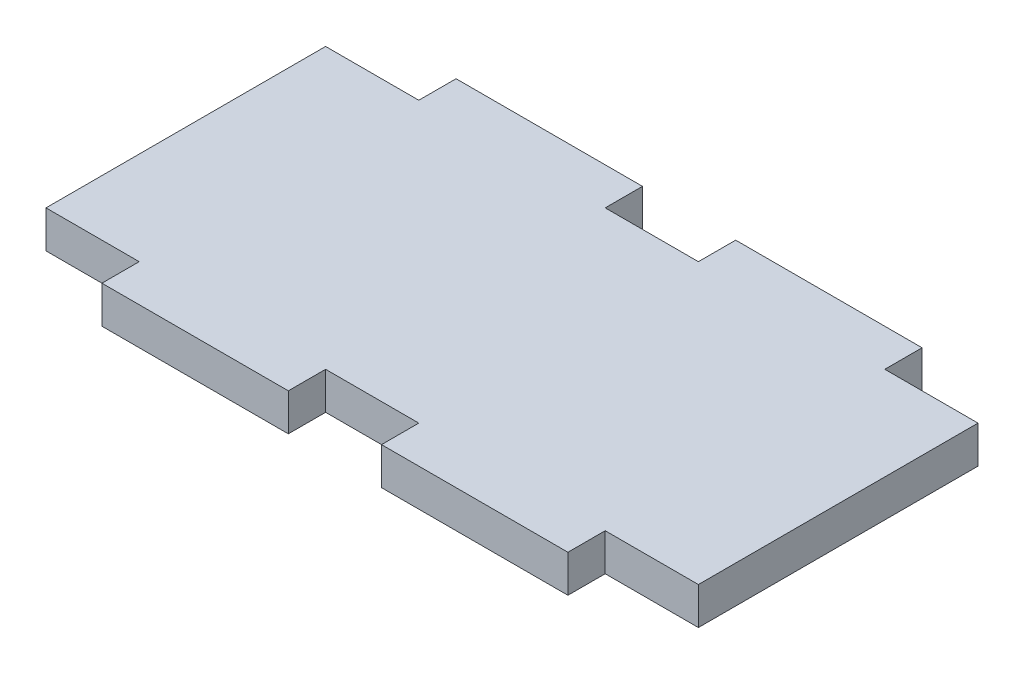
ISO-10303-21;
HEADER;
FILE_DESCRIPTION(('STEP AP214'),'2;1');
FILE_NAME('part.step','',(''),(''),'','','');
FILE_SCHEMA(('AUTOMOTIVE_DESIGN { 1 0 10303 214 1 1 1 1 }'));
ENDSEC;
DATA;
#1=APPLICATION_CONTEXT('core data for automotive mechanical design processes');
#2=APPLICATION_PROTOCOL_DEFINITION('international standard','automotive_design',2000,#1);
#3=PRODUCT_CONTEXT('',#1,'mechanical');
#4=PRODUCT('Part','Part','',(#3));
#5=PRODUCT_RELATED_PRODUCT_CATEGORY('part','',(#4));
#6=PRODUCT_DEFINITION_FORMATION('','',#4);
#7=PRODUCT_DEFINITION_CONTEXT('part definition',#1,'design');
#8=PRODUCT_DEFINITION('design','',#6,#7);
#9=PRODUCT_DEFINITION_SHAPE('','',#8);
#10=(LENGTH_UNIT() NAMED_UNIT(*) SI_UNIT(.MILLI.,.METRE.));
#11=(NAMED_UNIT(*) PLANE_ANGLE_UNIT() SI_UNIT($,.RADIAN.));
#12=(NAMED_UNIT(*) SI_UNIT($,.STERADIAN.) SOLID_ANGLE_UNIT());
#13=UNCERTAINTY_MEASURE_WITH_UNIT(LENGTH_MEASURE(1.E-05),#10,'distance_accuracy_value','');
#14=(GEOMETRIC_REPRESENTATION_CONTEXT(3) GLOBAL_UNCERTAINTY_ASSIGNED_CONTEXT((#13)) GLOBAL_UNIT_ASSIGNED_CONTEXT((#10,
#11,#12)) REPRESENTATION_CONTEXT('',''));
#15=CARTESIAN_POINT('',(0.,0.,0.));
#16=DIRECTION('',(0.,0.,1.));
#17=DIRECTION('',(1.,0.,0.));
#18=AXIS2_PLACEMENT_3D('',#15,#16,#17);
#19=CARTESIAN_POINT('',(0.,2.,-15.));
#20=DIRECTION('',(0.,0.,1.));
#21=DIRECTION('',(1.,0.,0.));
#22=AXIS2_PLACEMENT_3D('',#19,#20,#21);
#23=PLANE('',#22);
#24=DIRECTION('',(0.,-1.,0.));
#25=VECTOR('',#24,1.);
#26=CARTESIAN_POINT('',(15.,0.,-15.));
#27=LINE('',#26,#25);
#28=CARTESIAN_POINT('',(15.,2.,-15.));
#29=VERTEX_POINT('',#28);
#30=CARTESIAN_POINT('',(15.,0.,-15.));
#31=VERTEX_POINT('',#30);
#32=EDGE_CURVE('E56',#29,#31,#27,.T.);
#33=ORIENTED_EDGE('',*,*,#32,.F.);
#34=DIRECTION('',(-1.,0.,0.));
#35=VECTOR('',#34,1.);
#36=CARTESIAN_POINT('',(0.,2.,-15.));
#37=LINE('',#36,#35);
#38=CARTESIAN_POINT('',(20.,2.,-15.));
#39=VERTEX_POINT('',#38);
#40=EDGE_CURVE('E195',#39,#29,#37,.T.);
#41=ORIENTED_EDGE('',*,*,#40,.F.);
#42=DIRECTION('',(0.,1.,0.));
#43=VECTOR('',#42,1.);
#44=CARTESIAN_POINT('',(20.,2.,-15.));
#45=LINE('',#44,#43);
#46=CARTESIAN_POINT('',(20.,0.,-15.));
#47=VERTEX_POINT('',#46);
#48=EDGE_CURVE('E199',#47,#39,#45,.T.);
#49=ORIENTED_EDGE('',*,*,#48,.F.);
#50=DIRECTION('',(-1.,0.,0.));
#51=VECTOR('',#50,1.);
#52=CARTESIAN_POINT('',(0.,0.,-15.));
#53=LINE('',#52,#51);
#54=EDGE_CURVE('E306',#47,#31,#53,.T.);
#55=ORIENTED_EDGE('',*,*,#54,.T.);
#56=EDGE_LOOP('',(#33,#41,#49,#55));
#57=FACE_BOUND('',#56,.T.);
#58=ADVANCED_FACE('F33',(#57),#23,.F.);
#59=DIRECTION('',(0.,1.,0.));
#60=VECTOR('',#59,1.);
#61=CARTESIAN_POINT('',(5.,2.,-15.));
#62=LINE('',#61,#60);
#63=CARTESIAN_POINT('',(5.,0.,-15.));
#64=VERTEX_POINT('',#63);
#65=CARTESIAN_POINT('',(5.,2.,-15.));
#66=VERTEX_POINT('',#65);
#67=EDGE_CURVE('E190',#64,#66,#62,.T.);
#68=ORIENTED_EDGE('',*,*,#67,.F.);
#69=CARTESIAN_POINT('',(0.,0.,-15.));
#70=VERTEX_POINT('',#69);
#71=EDGE_CURVE('E304',#64,#70,#53,.T.);
#72=ORIENTED_EDGE('',*,*,#71,.T.);
#73=DIRECTION('',(0.,-1.,0.));
#74=VECTOR('',#73,1.);
#75=CARTESIAN_POINT('',(0.,2.,-15.));
#76=LINE('',#75,#74);
#77=CARTESIAN_POINT('',(0.,2.,-15.));
#78=VERTEX_POINT('',#77);
#79=EDGE_CURVE('E295',#78,#70,#76,.T.);
#80=ORIENTED_EDGE('',*,*,#79,.F.);
#81=EDGE_CURVE('E48',#66,#78,#37,.T.);
#82=ORIENTED_EDGE('',*,*,#81,.F.);
#83=EDGE_LOOP('',(#68,#72,#80,#82));
#84=FACE_BOUND('',#83,.T.);
#85=ADVANCED_FACE('F371',(#84),#23,.F.);
#86=DIRECTION('',(0.,-1.,0.));
#87=VECTOR('',#86,1.);
#88=CARTESIAN_POINT('',(30.,0.,-15.));
#89=LINE('',#88,#87);
#90=CARTESIAN_POINT('',(30.,2.,-15.));
#91=VERTEX_POINT('',#90);
#92=CARTESIAN_POINT('',(30.,0.,-15.));
#93=VERTEX_POINT('',#92);
#94=EDGE_CURVE('E196',#91,#93,#89,.T.);
#95=ORIENTED_EDGE('',*,*,#94,.F.);
#96=CARTESIAN_POINT('',(35.,2.,-15.));
#97=VERTEX_POINT('',#96);
#98=EDGE_CURVE('E292',#97,#91,#37,.T.);
#99=ORIENTED_EDGE('',*,*,#98,.F.);
#100=DIRECTION('',(0.,-1.,0.));
#101=VECTOR('',#100,1.);
#102=CARTESIAN_POINT('',(35.,2.,-15.));
#103=LINE('',#102,#101);
#104=CARTESIAN_POINT('',(35.,0.,-15.));
#105=VERTEX_POINT('',#104);
#106=EDGE_CURVE('E309',#97,#105,#103,.T.);
#107=ORIENTED_EDGE('',*,*,#106,.T.);
#108=EDGE_CURVE('E285',#105,#93,#53,.T.);
#109=ORIENTED_EDGE('',*,*,#108,.T.);
#110=EDGE_LOOP('',(#95,#99,#107,#109));
#111=FACE_BOUND('',#110,.T.);
#112=ADVANCED_FACE('F328',(#111),#23,.F.);
#113=CARTESIAN_POINT('',(0.,2.,0.));
#114=DIRECTION('',(0.,0.,-1.));
#115=DIRECTION('',(-1.,0.,0.));
#116=AXIS2_PLACEMENT_3D('',#113,#114,#115);
#117=PLANE('',#116);
#118=DIRECTION('',(0.,-1.,0.));
#119=VECTOR('',#118,1.);
#120=CARTESIAN_POINT('',(20.,2.,0.));
#121=LINE('',#120,#119);
#122=CARTESIAN_POINT('',(20.,2.,0.));
#123=VERTEX_POINT('',#122);
#124=CARTESIAN_POINT('',(20.,0.,0.));
#125=VERTEX_POINT('',#124);
#126=EDGE_CURVE('E227',#123,#125,#121,.T.);
#127=ORIENTED_EDGE('',*,*,#126,.F.);
#128=DIRECTION('',(1.,0.,0.));
#129=VECTOR('',#128,1.);
#130=CARTESIAN_POINT('',(0.,2.,0.));
#131=LINE('',#130,#129);
#132=CARTESIAN_POINT('',(15.,2.,0.));
#133=VERTEX_POINT('',#132);
#134=EDGE_CURVE('E290',#133,#123,#131,.T.);
#135=ORIENTED_EDGE('',*,*,#134,.F.);
#136=DIRECTION('',(0.,1.,0.));
#137=VECTOR('',#136,1.);
#138=CARTESIAN_POINT('',(15.,2.,0.));
#139=LINE('',#138,#137);
#140=CARTESIAN_POINT('',(15.,0.,0.));
#141=VERTEX_POINT('',#140);
#142=EDGE_CURVE('E259',#141,#133,#139,.T.);
#143=ORIENTED_EDGE('',*,*,#142,.F.);
#144=DIRECTION('',(1.,0.,0.));
#145=VECTOR('',#144,1.);
#146=CARTESIAN_POINT('',(0.,0.,0.));
#147=LINE('',#146,#145);
#148=EDGE_CURVE('E302',#141,#125,#147,.T.);
#149=ORIENTED_EDGE('',*,*,#148,.T.);
#150=EDGE_LOOP('',(#127,#135,#143,#149));
#151=FACE_BOUND('',#150,.T.);
#152=ADVANCED_FACE('F352',(#151),#117,.F.);
#153=DIRECTION('',(0.,1.,0.));
#154=VECTOR('',#153,1.);
#155=CARTESIAN_POINT('',(30.,2.,0.));
#156=LINE('',#155,#154);
#157=CARTESIAN_POINT('',(30.,0.,0.));
#158=VERTEX_POINT('',#157);
#159=CARTESIAN_POINT('',(30.,2.,0.));
#160=VERTEX_POINT('',#159);
#161=EDGE_CURVE('E232',#158,#160,#156,.T.);
#162=ORIENTED_EDGE('',*,*,#161,.F.);
#163=CARTESIAN_POINT('',(35.,0.,0.));
#164=VERTEX_POINT('',#163);
#165=EDGE_CURVE('E298',#158,#164,#147,.T.);
#166=ORIENTED_EDGE('',*,*,#165,.T.);
#167=DIRECTION('',(0.,-1.,0.));
#168=VECTOR('',#167,1.);
#169=CARTESIAN_POINT('',(35.,2.,0.));
#170=LINE('',#169,#168);
#171=CARTESIAN_POINT('',(35.,2.,0.));
#172=VERTEX_POINT('',#171);
#173=EDGE_CURVE('E41',#172,#164,#170,.T.);
#174=ORIENTED_EDGE('',*,*,#173,.F.);
#175=EDGE_CURVE('E284',#160,#172,#131,.T.);
#176=ORIENTED_EDGE('',*,*,#175,.F.);
#177=EDGE_LOOP('',(#162,#166,#174,#176));
#178=FACE_BOUND('',#177,.T.);
#179=ADVANCED_FACE('F350',(#178),#117,.F.);
#180=DIRECTION('',(0.,-1.,0.));
#181=VECTOR('',#180,1.);
#182=CARTESIAN_POINT('',(5.,2.,0.));
#183=LINE('',#182,#181);
#184=CARTESIAN_POINT('',(5.,2.,0.));
#185=VERTEX_POINT('',#184);
#186=CARTESIAN_POINT('',(5.,0.,0.));
#187=VERTEX_POINT('',#186);
#188=EDGE_CURVE('E254',#185,#187,#183,.T.);
#189=ORIENTED_EDGE('',*,*,#188,.F.);
#190=CARTESIAN_POINT('',(0.,2.,0.));
#191=VERTEX_POINT('',#190);
#192=EDGE_CURVE('E286',#191,#185,#131,.T.);
#193=ORIENTED_EDGE('',*,*,#192,.F.);
#194=DIRECTION('',(0.,-1.,0.));
#195=VECTOR('',#194,1.);
#196=CARTESIAN_POINT('',(0.,2.,0.));
#197=LINE('',#196,#195);
#198=CARTESIAN_POINT('',(0.,0.,0.));
#199=VERTEX_POINT('',#198);
#200=EDGE_CURVE('E11',#191,#199,#197,.T.);
#201=ORIENTED_EDGE('',*,*,#200,.T.);
#202=EDGE_CURVE('E299',#199,#187,#147,.T.);
#203=ORIENTED_EDGE('',*,*,#202,.T.);
#204=EDGE_LOOP('',(#189,#193,#201,#203));
#205=FACE_BOUND('',#204,.T.);
#206=ADVANCED_FACE('F365',(#205),#117,.F.);
#207=CARTESIAN_POINT('',(0.,2.,0.));
#208=DIRECTION('',(1.,0.,0.));
#209=DIRECTION('',(0.,0.,-1.));
#210=AXIS2_PLACEMENT_3D('',#207,#208,#209);
#211=PLANE('',#210);
#212=DIRECTION('',(0.,0.,1.));
#213=VECTOR('',#212,1.);
#214=CARTESIAN_POINT('',(0.,0.,0.));
#215=LINE('',#214,#213);
#216=EDGE_CURVE('E281',#70,#199,#215,.T.);
#217=ORIENTED_EDGE('',*,*,#216,.T.);
#218=ORIENTED_EDGE('',*,*,#200,.F.);
#219=DIRECTION('',(0.,0.,1.));
#220=VECTOR('',#219,1.);
#221=CARTESIAN_POINT('',(0.,2.,0.));
#222=LINE('',#221,#220);
#223=EDGE_CURVE('E282',#78,#191,#222,.T.);
#224=ORIENTED_EDGE('',*,*,#223,.F.);
#225=ORIENTED_EDGE('',*,*,#79,.T.);
#226=EDGE_LOOP('',(#217,#218,#224,#225));
#227=FACE_BOUND('',#226,.T.);
#228=ADVANCED_FACE('F35',(#227),#211,.F.);
#229=CARTESIAN_POINT('',(35.,2.,0.));
#230=DIRECTION('',(-1.,0.,0.));
#231=DIRECTION('',(0.,0.,1.));
#232=AXIS2_PLACEMENT_3D('',#229,#230,#231);
#233=PLANE('',#232);
#234=DIRECTION('',(0.,0.,-1.));
#235=VECTOR('',#234,1.);
#236=CARTESIAN_POINT('',(35.,0.,0.));
#237=LINE('',#236,#235);
#238=EDGE_CURVE('E301',#164,#105,#237,.T.);
#239=ORIENTED_EDGE('',*,*,#238,.T.);
#240=ORIENTED_EDGE('',*,*,#106,.F.);
#241=DIRECTION('',(0.,0.,-1.));
#242=VECTOR('',#241,1.);
#243=CARTESIAN_POINT('',(35.,2.,0.));
#244=LINE('',#243,#242);
#245=EDGE_CURVE('E289',#172,#97,#244,.T.);
#246=ORIENTED_EDGE('',*,*,#245,.F.);
#247=ORIENTED_EDGE('',*,*,#173,.T.);
#248=EDGE_LOOP('',(#239,#240,#246,#247));
#249=FACE_BOUND('',#248,.T.);
#250=ADVANCED_FACE('F316',(#249),#233,.F.);
#251=CARTESIAN_POINT('',(0.,2.,0.));
#252=DIRECTION('',(0.,-1.,0.));
#253=DIRECTION('',(0.,0.,-1.));
#254=AXIS2_PLACEMENT_3D('',#251,#252,#253);
#255=PLANE('',#254);
#256=ORIENTED_EDGE('',*,*,#223,.T.);
#257=ORIENTED_EDGE('',*,*,#192,.T.);
#258=DIRECTION('',(0.,0.,-1.));
#259=VECTOR('',#258,1.);
#260=CARTESIAN_POINT('',(5.,2.,2.));
#261=LINE('',#260,#259);
#262=CARTESIAN_POINT('',(5.,2.,2.));
#263=VERTEX_POINT('',#262);
#264=EDGE_CURVE('E265',#263,#185,#261,.T.);
#265=ORIENTED_EDGE('',*,*,#264,.F.);
#266=DIRECTION('',(-1.,0.,0.));
#267=VECTOR('',#266,1.);
#268=CARTESIAN_POINT('',(5.,2.,2.));
#269=LINE('',#268,#267);
#270=CARTESIAN_POINT('',(15.,2.,2.));
#271=VERTEX_POINT('',#270);
#272=EDGE_CURVE('E263',#271,#263,#269,.T.);
#273=ORIENTED_EDGE('',*,*,#272,.F.);
#274=DIRECTION('',(0.,0.,-1.));
#275=VECTOR('',#274,1.);
#276=CARTESIAN_POINT('',(15.,2.,2.));
#277=LINE('',#276,#275);
#278=EDGE_CURVE('E272',#271,#133,#277,.T.);
#279=ORIENTED_EDGE('',*,*,#278,.T.);
#280=ORIENTED_EDGE('',*,*,#134,.T.);
#281=DIRECTION('',(0.,0.,-1.));
#282=VECTOR('',#281,1.);
#283=CARTESIAN_POINT('',(20.,2.,2.));
#284=LINE('',#283,#282);
#285=CARTESIAN_POINT('',(20.,2.,2.));
#286=VERTEX_POINT('',#285);
#287=EDGE_CURVE('E238',#286,#123,#284,.T.);
#288=ORIENTED_EDGE('',*,*,#287,.F.);
#289=DIRECTION('',(-1.,0.,0.));
#290=VECTOR('',#289,1.);
#291=CARTESIAN_POINT('',(20.,2.,2.));
#292=LINE('',#291,#290);
#293=CARTESIAN_POINT('',(30.,2.,2.));
#294=VERTEX_POINT('',#293);
#295=EDGE_CURVE('E236',#294,#286,#292,.T.);
#296=ORIENTED_EDGE('',*,*,#295,.F.);
#297=DIRECTION('',(0.,0.,-1.));
#298=VECTOR('',#297,1.);
#299=CARTESIAN_POINT('',(30.,2.,2.));
#300=LINE('',#299,#298);
#301=EDGE_CURVE('E245',#294,#160,#300,.T.);
#302=ORIENTED_EDGE('',*,*,#301,.T.);
#303=ORIENTED_EDGE('',*,*,#175,.T.);
#304=ORIENTED_EDGE('',*,*,#245,.T.);
#305=ORIENTED_EDGE('',*,*,#98,.T.);
#306=DIRECTION('',(0.,0.,1.));
#307=VECTOR('',#306,1.);
#308=CARTESIAN_POINT('',(30.,2.,-17.));
#309=LINE('',#308,#307);
#310=CARTESIAN_POINT('',(30.,2.,-17.));
#311=VERTEX_POINT('',#310);
#312=EDGE_CURVE('E224',#311,#91,#309,.T.);
#313=ORIENTED_EDGE('',*,*,#312,.F.);
#314=DIRECTION('',(1.,0.,0.));
#315=VECTOR('',#314,1.);
#316=CARTESIAN_POINT('',(30.,2.,-17.));
#317=LINE('',#316,#315);
#318=CARTESIAN_POINT('',(20.,2.,-17.));
#319=VERTEX_POINT('',#318);
#320=EDGE_CURVE('E205',#319,#311,#317,.T.);
#321=ORIENTED_EDGE('',*,*,#320,.F.);
#322=DIRECTION('',(0.,0.,1.));
#323=VECTOR('',#322,1.);
#324=CARTESIAN_POINT('',(20.,2.,-17.));
#325=LINE('',#324,#323);
#326=EDGE_CURVE('E213',#319,#39,#325,.T.);
#327=ORIENTED_EDGE('',*,*,#326,.T.);
#328=ORIENTED_EDGE('',*,*,#40,.T.);
#329=DIRECTION('',(0.,0.,1.));
#330=VECTOR('',#329,1.);
#331=CARTESIAN_POINT('',(15.,2.,-17.));
#332=LINE('',#331,#330);
#333=CARTESIAN_POINT('',(15.,2.,-17.));
#334=VERTEX_POINT('',#333);
#335=EDGE_CURVE('E175',#334,#29,#332,.T.);
#336=ORIENTED_EDGE('',*,*,#335,.F.);
#337=DIRECTION('',(1.,0.,0.));
#338=VECTOR('',#337,1.);
#339=CARTESIAN_POINT('',(15.,2.,-17.));
#340=LINE('',#339,#338);
#341=CARTESIAN_POINT('',(5.,2.,-17.));
#342=VERTEX_POINT('',#341);
#343=EDGE_CURVE('E181',#342,#334,#340,.T.);
#344=ORIENTED_EDGE('',*,*,#343,.F.);
#345=DIRECTION('',(0.,0.,1.));
#346=VECTOR('',#345,1.);
#347=CARTESIAN_POINT('',(5.,2.,-17.));
#348=LINE('',#347,#346);
#349=EDGE_CURVE('E375',#342,#66,#348,.T.);
#350=ORIENTED_EDGE('',*,*,#349,.T.);
#351=ORIENTED_EDGE('',*,*,#81,.T.);
#352=EDGE_LOOP('',(#256,#257,#265,#273,#279,#280,#288,#296,#302,#303,#304,#305,#313,#321,#327,
#328,#336,#344,#350,#351));
#353=FACE_BOUND('',#352,.T.);
#354=ADVANCED_FACE('F193',(#353),#255,.F.);
#355=CARTESIAN_POINT('',(0.,0.,0.));
#356=DIRECTION('',(0.,-1.,0.));
#357=DIRECTION('',(0.,0.,-1.));
#358=AXIS2_PLACEMENT_3D('',#355,#356,#357);
#359=PLANE('',#358);
#360=ORIENTED_EDGE('',*,*,#216,.F.);
#361=ORIENTED_EDGE('',*,*,#71,.F.);
#362=DIRECTION('',(0.,0.,1.));
#363=VECTOR('',#362,1.);
#364=CARTESIAN_POINT('',(5.,0.,-17.));
#365=LINE('',#364,#363);
#366=CARTESIAN_POINT('',(5.,0.,-17.));
#367=VERTEX_POINT('',#366);
#368=EDGE_CURVE('E201',#367,#64,#365,.T.);
#369=ORIENTED_EDGE('',*,*,#368,.F.);
#370=DIRECTION('',(-1.,0.,0.));
#371=VECTOR('',#370,1.);
#372=CARTESIAN_POINT('',(5.,0.,-17.));
#373=LINE('',#372,#371);
#374=CARTESIAN_POINT('',(15.,0.,-17.));
#375=VERTEX_POINT('',#374);
#376=EDGE_CURVE('E180',#375,#367,#373,.T.);
#377=ORIENTED_EDGE('',*,*,#376,.F.);
#378=DIRECTION('',(0.,0.,1.));
#379=VECTOR('',#378,1.);
#380=CARTESIAN_POINT('',(15.,0.,-17.));
#381=LINE('',#380,#379);
#382=EDGE_CURVE('E177',#375,#31,#381,.T.);
#383=ORIENTED_EDGE('',*,*,#382,.T.);
#384=ORIENTED_EDGE('',*,*,#54,.F.);
#385=DIRECTION('',(0.,0.,1.));
#386=VECTOR('',#385,1.);
#387=CARTESIAN_POINT('',(20.,0.,-17.));
#388=LINE('',#387,#386);
#389=CARTESIAN_POINT('',(20.,0.,-17.));
#390=VERTEX_POINT('',#389);
#391=EDGE_CURVE('E218',#390,#47,#388,.T.);
#392=ORIENTED_EDGE('',*,*,#391,.F.);
#393=DIRECTION('',(-1.,0.,0.));
#394=VECTOR('',#393,1.);
#395=CARTESIAN_POINT('',(20.,0.,-17.));
#396=LINE('',#395,#394);
#397=CARTESIAN_POINT('',(30.,0.,-17.));
#398=VERTEX_POINT('',#397);
#399=EDGE_CURVE('E210',#398,#390,#396,.T.);
#400=ORIENTED_EDGE('',*,*,#399,.F.);
#401=DIRECTION('',(0.,0.,1.));
#402=VECTOR('',#401,1.);
#403=CARTESIAN_POINT('',(30.,0.,-17.));
#404=LINE('',#403,#402);
#405=EDGE_CURVE('E221',#398,#93,#404,.T.);
#406=ORIENTED_EDGE('',*,*,#405,.T.);
#407=ORIENTED_EDGE('',*,*,#108,.F.);
#408=ORIENTED_EDGE('',*,*,#238,.F.);
#409=ORIENTED_EDGE('',*,*,#165,.F.);
#410=DIRECTION('',(0.,0.,-1.));
#411=VECTOR('',#410,1.);
#412=CARTESIAN_POINT('',(30.,0.,2.));
#413=LINE('',#412,#411);
#414=CARTESIAN_POINT('',(30.,0.,2.));
#415=VERTEX_POINT('',#414);
#416=EDGE_CURVE('E248',#415,#158,#413,.T.);
#417=ORIENTED_EDGE('',*,*,#416,.F.);
#418=DIRECTION('',(1.,0.,0.));
#419=VECTOR('',#418,1.);
#420=CARTESIAN_POINT('',(20.,0.,2.));
#421=LINE('',#420,#419);
#422=CARTESIAN_POINT('',(20.,0.,2.));
#423=VERTEX_POINT('',#422);
#424=EDGE_CURVE('E231',#423,#415,#421,.T.);
#425=ORIENTED_EDGE('',*,*,#424,.F.);
#426=DIRECTION('',(0.,0.,-1.));
#427=VECTOR('',#426,1.);
#428=CARTESIAN_POINT('',(20.,0.,2.));
#429=LINE('',#428,#427);
#430=EDGE_CURVE('E251',#423,#125,#429,.T.);
#431=ORIENTED_EDGE('',*,*,#430,.T.);
#432=ORIENTED_EDGE('',*,*,#148,.F.);
#433=DIRECTION('',(0.,0.,-1.));
#434=VECTOR('',#433,1.);
#435=CARTESIAN_POINT('',(15.,0.,2.));
#436=LINE('',#435,#434);
#437=CARTESIAN_POINT('',(15.,0.,2.));
#438=VERTEX_POINT('',#437);
#439=EDGE_CURVE('E275',#438,#141,#436,.T.);
#440=ORIENTED_EDGE('',*,*,#439,.F.);
#441=DIRECTION('',(1.,0.,0.));
#442=VECTOR('',#441,1.);
#443=CARTESIAN_POINT('',(5.,0.,2.));
#444=LINE('',#443,#442);
#445=CARTESIAN_POINT('',(5.,0.,2.));
#446=VERTEX_POINT('',#445);
#447=EDGE_CURVE('E258',#446,#438,#444,.T.);
#448=ORIENTED_EDGE('',*,*,#447,.F.);
#449=DIRECTION('',(0.,0.,-1.));
#450=VECTOR('',#449,1.);
#451=CARTESIAN_POINT('',(5.,0.,2.));
#452=LINE('',#451,#450);
#453=EDGE_CURVE('E278',#446,#187,#452,.T.);
#454=ORIENTED_EDGE('',*,*,#453,.T.);
#455=ORIENTED_EDGE('',*,*,#202,.F.);
#456=EDGE_LOOP('',(#360,#361,#369,#377,#383,#384,#392,#400,#406,#407,#408,#409,#417,#425,#431,
#432,#440,#448,#454,#455));
#457=FACE_BOUND('',#456,.T.);
#458=ADVANCED_FACE('F322',(#457),#359,.T.);
#459=CARTESIAN_POINT('',(5.,2.,2.));
#460=DIRECTION('',(1.,0.,0.));
#461=DIRECTION('',(0.,0.,-1.));
#462=AXIS2_PLACEMENT_3D('',#459,#460,#461);
#463=PLANE('',#462);
#464=ORIENTED_EDGE('',*,*,#188,.T.);
#465=ORIENTED_EDGE('',*,*,#453,.F.);
#466=DIRECTION('',(0.,-1.,0.));
#467=VECTOR('',#466,1.);
#468=CARTESIAN_POINT('',(5.,2.,2.));
#469=LINE('',#468,#467);
#470=EDGE_CURVE('E255',#263,#446,#469,.T.);
#471=ORIENTED_EDGE('',*,*,#470,.F.);
#472=ORIENTED_EDGE('',*,*,#264,.T.);
#473=EDGE_LOOP('',(#464,#465,#471,#472));
#474=FACE_BOUND('',#473,.T.);
#475=ADVANCED_FACE('F363',(#474),#463,.F.);
#476=CARTESIAN_POINT('',(15.,2.,2.));
#477=DIRECTION('',(-1.,0.,0.));
#478=DIRECTION('',(0.,0.,1.));
#479=AXIS2_PLACEMENT_3D('',#476,#477,#478);
#480=PLANE('',#479);
#481=ORIENTED_EDGE('',*,*,#142,.T.);
#482=ORIENTED_EDGE('',*,*,#278,.F.);
#483=DIRECTION('',(0.,1.,0.));
#484=VECTOR('',#483,1.);
#485=CARTESIAN_POINT('',(15.,2.,2.));
#486=LINE('',#485,#484);
#487=EDGE_CURVE('E261',#438,#271,#486,.T.);
#488=ORIENTED_EDGE('',*,*,#487,.F.);
#489=ORIENTED_EDGE('',*,*,#439,.T.);
#490=EDGE_LOOP('',(#481,#482,#488,#489));
#491=FACE_BOUND('',#490,.T.);
#492=ADVANCED_FACE('F356',(#491),#480,.F.);
#493=CARTESIAN_POINT('',(0.,0.,2.));
#494=DIRECTION('',(0.,0.,1.));
#495=DIRECTION('',(1.,0.,0.));
#496=AXIS2_PLACEMENT_3D('',#493,#494,#495);
#497=PLANE('',#496);
#498=ORIENTED_EDGE('',*,*,#470,.T.);
#499=ORIENTED_EDGE('',*,*,#447,.T.);
#500=ORIENTED_EDGE('',*,*,#487,.T.);
#501=ORIENTED_EDGE('',*,*,#272,.T.);
#502=EDGE_LOOP('',(#498,#499,#500,#501));
#503=FACE_BOUND('',#502,.T.);
#504=ADVANCED_FACE('F358',(#503),#497,.T.);
#505=CARTESIAN_POINT('',(20.,2.,2.));
#506=DIRECTION('',(1.,0.,0.));
#507=DIRECTION('',(0.,0.,-1.));
#508=AXIS2_PLACEMENT_3D('',#505,#506,#507);
#509=PLANE('',#508);
#510=ORIENTED_EDGE('',*,*,#126,.T.);
#511=ORIENTED_EDGE('',*,*,#430,.F.);
#512=DIRECTION('',(0.,-1.,0.));
#513=VECTOR('',#512,1.);
#514=CARTESIAN_POINT('',(20.,2.,2.));
#515=LINE('',#514,#513);
#516=EDGE_CURVE('E228',#286,#423,#515,.T.);
#517=ORIENTED_EDGE('',*,*,#516,.F.);
#518=ORIENTED_EDGE('',*,*,#287,.T.);
#519=EDGE_LOOP('',(#510,#511,#517,#518));
#520=FACE_BOUND('',#519,.T.);
#521=ADVANCED_FACE('F343',(#520),#509,.F.);
#522=CARTESIAN_POINT('',(30.,2.,2.));
#523=DIRECTION('',(-1.,0.,0.));
#524=DIRECTION('',(0.,0.,1.));
#525=AXIS2_PLACEMENT_3D('',#522,#523,#524);
#526=PLANE('',#525);
#527=ORIENTED_EDGE('',*,*,#161,.T.);
#528=ORIENTED_EDGE('',*,*,#301,.F.);
#529=DIRECTION('',(0.,1.,0.));
#530=VECTOR('',#529,1.);
#531=CARTESIAN_POINT('',(30.,2.,2.));
#532=LINE('',#531,#530);
#533=EDGE_CURVE('E234',#415,#294,#532,.T.);
#534=ORIENTED_EDGE('',*,*,#533,.F.);
#535=ORIENTED_EDGE('',*,*,#416,.T.);
#536=EDGE_LOOP('',(#527,#528,#534,#535));
#537=FACE_BOUND('',#536,.T.);
#538=ADVANCED_FACE('F349',(#537),#526,.F.);
#539=CARTESIAN_POINT('',(15.,0.,2.));
#540=DIRECTION('',(0.,0.,1.));
#541=DIRECTION('',(1.,0.,0.));
#542=AXIS2_PLACEMENT_3D('',#539,#540,#541);
#543=PLANE('',#542);
#544=ORIENTED_EDGE('',*,*,#516,.T.);
#545=ORIENTED_EDGE('',*,*,#424,.T.);
#546=ORIENTED_EDGE('',*,*,#533,.T.);
#547=ORIENTED_EDGE('',*,*,#295,.T.);
#548=EDGE_LOOP('',(#544,#545,#546,#547));
#549=FACE_BOUND('',#548,.T.);
#550=ADVANCED_FACE('F346',(#549),#543,.T.);
#551=CARTESIAN_POINT('',(30.,0.,-17.));
#552=DIRECTION('',(-1.,0.,0.));
#553=DIRECTION('',(0.,0.,1.));
#554=AXIS2_PLACEMENT_3D('',#551,#552,#553);
#555=PLANE('',#554);
#556=ORIENTED_EDGE('',*,*,#94,.T.);
#557=ORIENTED_EDGE('',*,*,#405,.F.);
#558=DIRECTION('',(0.,-1.,0.));
#559=VECTOR('',#558,1.);
#560=CARTESIAN_POINT('',(30.,0.,-17.));
#561=LINE('',#560,#559);
#562=EDGE_CURVE('E208',#311,#398,#561,.T.);
#563=ORIENTED_EDGE('',*,*,#562,.F.);
#564=ORIENTED_EDGE('',*,*,#312,.T.);
#565=EDGE_LOOP('',(#556,#557,#563,#564));
#566=FACE_BOUND('',#565,.T.);
#567=ADVANCED_FACE('F331',(#566),#555,.F.);
#568=CARTESIAN_POINT('',(20.,2.,-17.));
#569=DIRECTION('',(1.,0.,0.));
#570=DIRECTION('',(0.,0.,-1.));
#571=AXIS2_PLACEMENT_3D('',#568,#569,#570);
#572=PLANE('',#571);
#573=ORIENTED_EDGE('',*,*,#48,.T.);
#574=ORIENTED_EDGE('',*,*,#326,.F.);
#575=DIRECTION('',(0.,1.,0.));
#576=VECTOR('',#575,1.);
#577=CARTESIAN_POINT('',(20.,2.,-17.));
#578=LINE('',#577,#576);
#579=EDGE_CURVE('E212',#390,#319,#578,.T.);
#580=ORIENTED_EDGE('',*,*,#579,.F.);
#581=ORIENTED_EDGE('',*,*,#391,.T.);
#582=EDGE_LOOP('',(#573,#574,#580,#581));
#583=FACE_BOUND('',#582,.T.);
#584=ADVANCED_FACE('F384',(#583),#572,.F.);
#585=CARTESIAN_POINT('',(0.,0.,-17.));
#586=DIRECTION('',(0.,0.,1.));
#587=DIRECTION('',(1.,0.,0.));
#588=AXIS2_PLACEMENT_3D('',#585,#586,#587);
#589=PLANE('',#588);
#590=ORIENTED_EDGE('',*,*,#320,.T.);
#591=ORIENTED_EDGE('',*,*,#562,.T.);
#592=ORIENTED_EDGE('',*,*,#399,.T.);
#593=ORIENTED_EDGE('',*,*,#579,.T.);
#594=EDGE_LOOP('',(#590,#591,#592,#593));
#595=FACE_BOUND('',#594,.T.);
#596=ADVANCED_FACE('F387',(#595),#589,.F.);
#597=CARTESIAN_POINT('',(15.,0.,-17.));
#598=DIRECTION('',(-1.,0.,0.));
#599=DIRECTION('',(0.,0.,1.));
#600=AXIS2_PLACEMENT_3D('',#597,#598,#599);
#601=PLANE('',#600);
#602=ORIENTED_EDGE('',*,*,#32,.T.);
#603=ORIENTED_EDGE('',*,*,#382,.F.);
#604=DIRECTION('',(0.,-1.,0.));
#605=VECTOR('',#604,1.);
#606=CARTESIAN_POINT('',(15.,0.,-17.));
#607=LINE('',#606,#605);
#608=EDGE_CURVE('E171',#334,#375,#607,.T.);
#609=ORIENTED_EDGE('',*,*,#608,.F.);
#610=ORIENTED_EDGE('',*,*,#335,.T.);
#611=EDGE_LOOP('',(#602,#603,#609,#610));
#612=FACE_BOUND('',#611,.T.);
#613=ADVANCED_FACE('F173',(#612),#601,.F.);
#614=CARTESIAN_POINT('',(5.,2.,-17.));
#615=DIRECTION('',(1.,0.,0.));
#616=DIRECTION('',(0.,0.,-1.));
#617=AXIS2_PLACEMENT_3D('',#614,#615,#616);
#618=PLANE('',#617);
#619=ORIENTED_EDGE('',*,*,#67,.T.);
#620=ORIENTED_EDGE('',*,*,#349,.F.);
#621=DIRECTION('',(0.,1.,0.));
#622=VECTOR('',#621,1.);
#623=CARTESIAN_POINT('',(5.,2.,-17.));
#624=LINE('',#623,#622);
#625=EDGE_CURVE('E186',#367,#342,#624,.T.);
#626=ORIENTED_EDGE('',*,*,#625,.F.);
#627=ORIENTED_EDGE('',*,*,#368,.T.);
#628=EDGE_LOOP('',(#619,#620,#626,#627));
#629=FACE_BOUND('',#628,.T.);
#630=ADVANCED_FACE('F374',(#629),#618,.F.);
#631=CARTESIAN_POINT('',(0.,0.,-17.));
#632=DIRECTION('',(0.,0.,1.));
#633=DIRECTION('',(1.,0.,0.));
#634=AXIS2_PLACEMENT_3D('',#631,#632,#633);
#635=PLANE('',#634);
#636=ORIENTED_EDGE('',*,*,#343,.T.);
#637=ORIENTED_EDGE('',*,*,#608,.T.);
#638=ORIENTED_EDGE('',*,*,#376,.T.);
#639=ORIENTED_EDGE('',*,*,#625,.T.);
#640=EDGE_LOOP('',(#636,#637,#638,#639));
#641=FACE_BOUND('',#640,.T.);
#642=ADVANCED_FACE('F184',(#641),#635,.F.);
#643=CLOSED_SHELL('',(#58,#85,#112,#152,#179,#206,#228,#250,#354,#458,#475,#492,#504,#521,#538,
#550,#567,#584,#596,#613,#630,#642));
#644=MANIFOLD_SOLID_BREP('B2',#643);
#645=ADVANCED_BREP_SHAPE_REPRESENTATION('',(#18,#644),#14);
#646=SHAPE_DEFINITION_REPRESENTATION(#9,#645);
ENDSEC;
END-ISO-10303-21;
